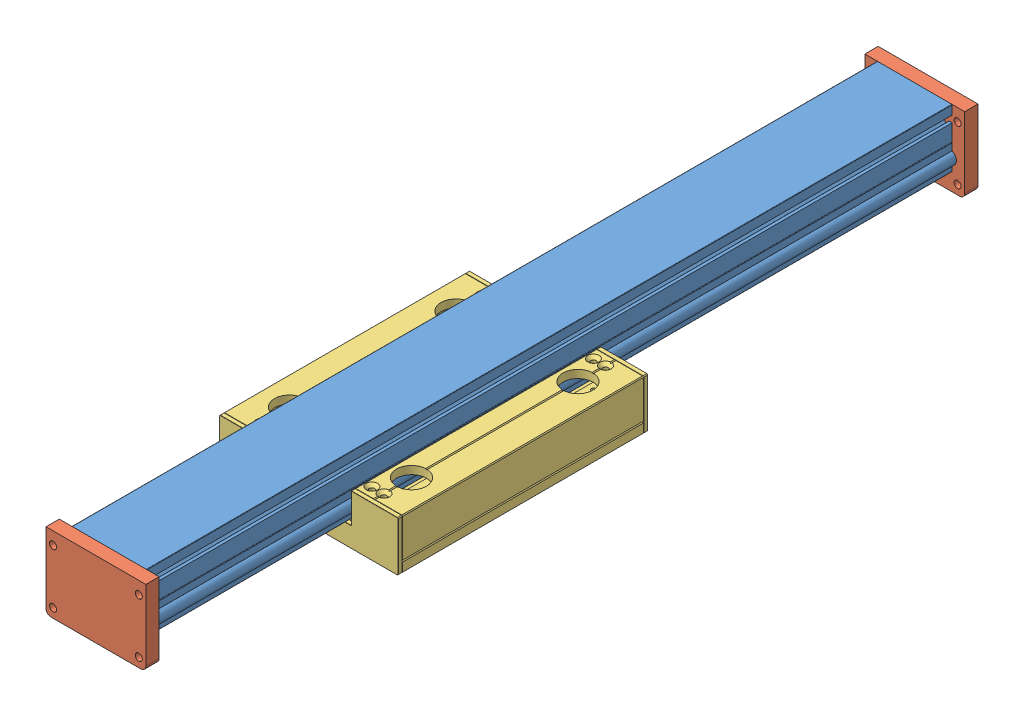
SolidWorks assembly MO090_300_1000.SLDASM, configuration Standard (file format 3800). Lengths in mm.
Overall size (215 95 1000).
4 component instances, 3 part files, 8 mates.
Components (placement in the parent):
- Profil_MZ090-1: Profil_MZ090.SLDPRT [l=968] at origin size (100.1 70 968)
- Endplatte_MO090-1: Endplatte_MO090.SLDPRT [vereinfacht] at (0 -13 0) x (0 0 1) z (1 0 0) size (16 91 120)
- Endplatte_MO090-2: Endplatte_MO090.SLDPRT [vereinfacht] at (0 -13 968) x (0 0 -1) z (-1 0 0) size (16 91 120)
- Schlitten_MZK090_300-1: Schlitten_MZK090_300.SLDPRT [Standard] at (0 35 578.2523) x (-1 0 0) z (0 0 1) size (215 60 300)
Mates (geometry in assembly coordinates):
- Deckungsgleich1: coincident anti-aligned: plane of Profil_MZ090-1 through (-45 35 0) normal (0 0 -1); plane of Endplatte_MO090-1 through (-54 -50 0) normal (0 0 1)
- Deckungsgleich2: coincident aligned: plane of Endplatte_MO090-1 through (60 35 -16) normal (0 1 0); plane of Profil_MZ090-1 through (-45 35 968) normal (0 1 0)
- Breite1: width: plane of Endplatte_MO090-1 through (60 -50 -16) normal (1 0 0); plane of Endplatte_MO090-1 through (-60 -50 -16) normal (-1 0 0); plane of Profil_MZ090-1 through (-45 35 968) normal (-1 0 0); plane of Profil_MZ090-1 through (45 35 968) normal (1 0 0)
- Deckungsgleich3: coincident anti-aligned: plane of Profil_MZ090-1 through (-45 35 968) normal (0 0 1); plane of Endplatte_MO090-2 through (54 -50 968) normal (0 0 -1)
- Deckungsgleich4: coincident aligned: plane of Endplatte_MO090-2 through (-60 35 984) normal (0 1 0); plane of Profil_MZ090-1 through (-45 35 968) normal (0 1 0)
- Breite2: width: plane of Endplatte_MO090-2 through (60 -50 984) normal (1 0 0); plane of Endplatte_MO090-2 through (-60 -50 984) normal (-1 0 0); plane of Profil_MZ090-1 through (-45 35 968) normal (-1 0 0); plane of Profil_MZ090-1 through (45 35 968) normal (1 0 0)
- Abstand1: distance = 95 mm anti-aligned: plane of Schlitten_MZK090_300-1 through (-107.5 -60 723.2523) normal (0 -1 0); plane of Profil_MZ090-1 through (-45 35 968) normal (0 1 0)
- Breite3: width: plane of Schlitten_MZK090_300-1 through (107.5 -60 723.2523) normal (1 0 0); plane of Schlitten_MZK090_300-1 through (-107.5 -60 723.2523) normal (-1 0 0); plane of Profil_MZ090-1 through (-45 35 968) normal (-1 0 0); plane of Profil_MZ090-1 through (45 35 968) normal (1 0 0)
